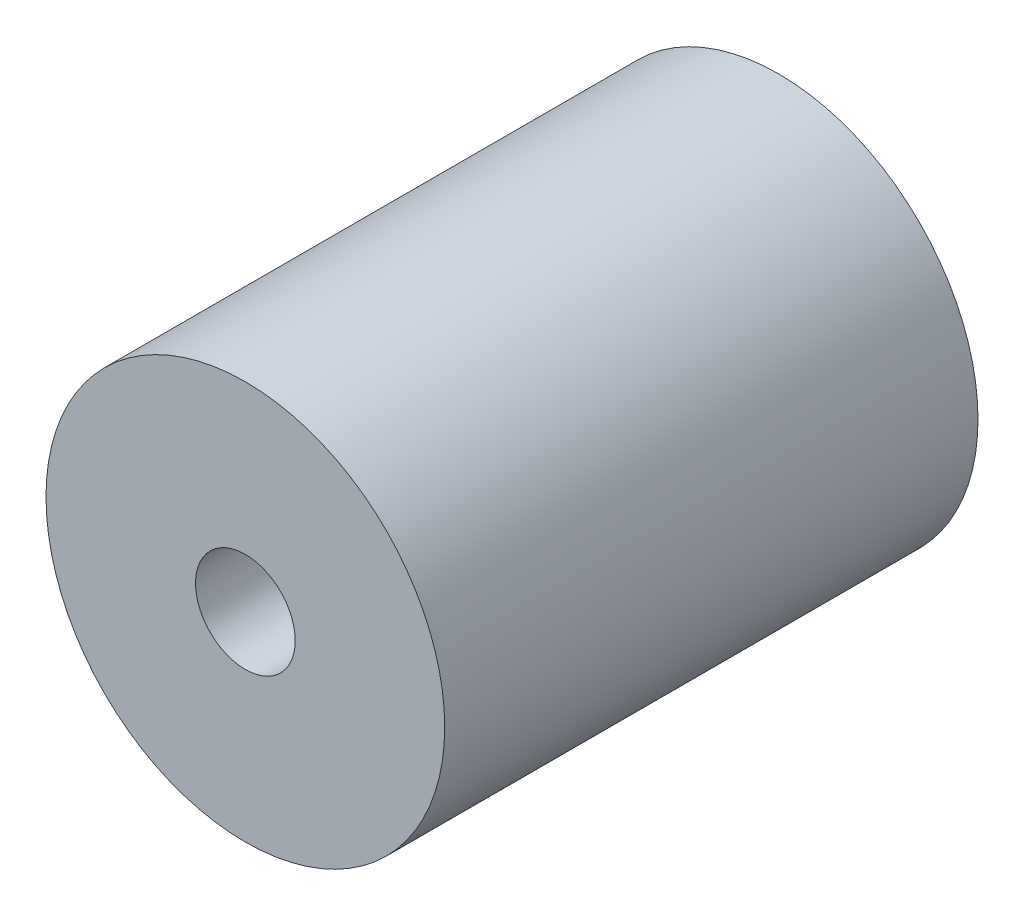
ISO-10303-21;
HEADER;
FILE_DESCRIPTION(('STEP AP214'),'2;1');
FILE_NAME('part.step','',(''),(''),'','','');
FILE_SCHEMA(('AUTOMOTIVE_DESIGN { 1 0 10303 214 1 1 1 1 }'));
ENDSEC;
DATA;
#1=APPLICATION_CONTEXT('core data for automotive mechanical design processes');
#2=APPLICATION_PROTOCOL_DEFINITION('international standard','automotive_design',2000,#1);
#3=PRODUCT_CONTEXT('',#1,'mechanical');
#4=PRODUCT('Part','Part','',(#3));
#5=PRODUCT_RELATED_PRODUCT_CATEGORY('part','',(#4));
#6=PRODUCT_DEFINITION_FORMATION('','',#4);
#7=PRODUCT_DEFINITION_CONTEXT('part definition',#1,'design');
#8=PRODUCT_DEFINITION('design','',#6,#7);
#9=PRODUCT_DEFINITION_SHAPE('','',#8);
#10=(LENGTH_UNIT() NAMED_UNIT(*) SI_UNIT(.MILLI.,.METRE.));
#11=(NAMED_UNIT(*) PLANE_ANGLE_UNIT() SI_UNIT($,.RADIAN.));
#12=(NAMED_UNIT(*) SI_UNIT($,.STERADIAN.) SOLID_ANGLE_UNIT());
#13=UNCERTAINTY_MEASURE_WITH_UNIT(LENGTH_MEASURE(1.E-05),#10,'distance_accuracy_value','');
#14=(GEOMETRIC_REPRESENTATION_CONTEXT(3) GLOBAL_UNCERTAINTY_ASSIGNED_CONTEXT((#13)) GLOBAL_UNIT_ASSIGNED_CONTEXT((#10,
#11,#12)) REPRESENTATION_CONTEXT('',''));
#15=CARTESIAN_POINT('',(0.,0.,0.));
#16=DIRECTION('',(0.,0.,1.));
#17=DIRECTION('',(1.,0.,0.));
#18=AXIS2_PLACEMENT_3D('',#15,#16,#17);
#19=CARTESIAN_POINT('',(0.,0.,10.7));
#20=DIRECTION('',(0.,0.,1.));
#21=DIRECTION('',(1.,0.,0.));
#22=AXIS2_PLACEMENT_3D('',#19,#20,#21);
#23=PLANE('',#22);
#24=CARTESIAN_POINT('',(0.,0.,10.7));
#25=DIRECTION('',(0.,0.,1.));
#26=DIRECTION('',(1.,0.,0.));
#27=AXIS2_PLACEMENT_3D('',#24,#25,#26);
#28=CIRCLE('',#27,4.);
#29=CARTESIAN_POINT('',(4.,0.,10.7));
#30=VERTEX_POINT('',#29);
#31=EDGE_CURVE('E10',#30,#30,#28,.T.);
#32=ORIENTED_EDGE('',*,*,#31,.T.);
#33=EDGE_LOOP('',(#32));
#34=FACE_BOUND('',#33,.T.);
#35=CARTESIAN_POINT('',(0.,0.,10.7));
#36=DIRECTION('',(0.,0.,1.));
#37=DIRECTION('',(1.,0.,0.));
#38=AXIS2_PLACEMENT_3D('',#35,#36,#37);
#39=CIRCLE('',#38,1.);
#40=CARTESIAN_POINT('',(1.,0.,10.7));
#41=VERTEX_POINT('',#40);
#42=EDGE_CURVE('E49',#41,#41,#39,.T.);
#43=ORIENTED_EDGE('',*,*,#42,.F.);
#44=EDGE_LOOP('',(#43));
#45=FACE_BOUND('',#44,.T.);
#46=ADVANCED_FACE('F38',(#34,#45),#23,.T.);
#47=CARTESIAN_POINT('',(0.,0.,0.));
#48=DIRECTION('',(0.,0.,1.));
#49=DIRECTION('',(1.,0.,0.));
#50=AXIS2_PLACEMENT_3D('',#47,#48,#49);
#51=PLANE('',#50);
#52=CARTESIAN_POINT('',(0.,0.,0.));
#53=DIRECTION('',(0.,0.,1.));
#54=DIRECTION('',(1.,0.,0.));
#55=AXIS2_PLACEMENT_3D('',#52,#53,#54);
#56=CIRCLE('',#55,4.);
#57=CARTESIAN_POINT('',(4.,0.,0.));
#58=VERTEX_POINT('',#57);
#59=EDGE_CURVE('E42',#58,#58,#56,.T.);
#60=ORIENTED_EDGE('',*,*,#59,.F.);
#61=EDGE_LOOP('',(#60));
#62=FACE_BOUND('',#61,.T.);
#63=CARTESIAN_POINT('',(0.,0.,0.));
#64=DIRECTION('',(0.,0.,1.));
#65=DIRECTION('',(1.,0.,0.));
#66=AXIS2_PLACEMENT_3D('',#63,#64,#65);
#67=CIRCLE('',#66,1.);
#68=CARTESIAN_POINT('',(1.,0.,0.));
#69=VERTEX_POINT('',#68);
#70=EDGE_CURVE('E51',#69,#69,#67,.T.);
#71=ORIENTED_EDGE('',*,*,#70,.T.);
#72=EDGE_LOOP('',(#71));
#73=FACE_BOUND('',#72,.T.);
#74=ADVANCED_FACE('F61',(#62,#73),#51,.F.);
#75=CARTESIAN_POINT('',(0.,0.,10.7));
#76=DIRECTION('',(0.,0.,-1.));
#77=DIRECTION('',(-1.,0.,0.));
#78=AXIS2_PLACEMENT_3D('',#75,#76,#77);
#79=CYLINDRICAL_SURFACE('',#78,4.);
#80=ORIENTED_EDGE('',*,*,#31,.F.);
#81=EDGE_LOOP('',(#80));
#82=FACE_BOUND('',#81,.T.);
#83=ORIENTED_EDGE('',*,*,#59,.T.);
#84=EDGE_LOOP('',(#83));
#85=FACE_BOUND('',#84,.T.);
#86=ADVANCED_FACE('F40',(#82,#85),#79,.T.);
#87=CARTESIAN_POINT('',(0.,0.,10.7));
#88=DIRECTION('',(0.,0.,-1.));
#89=DIRECTION('',(-1.,0.,0.));
#90=AXIS2_PLACEMENT_3D('',#87,#88,#89);
#91=CYLINDRICAL_SURFACE('',#90,1.);
#92=ORIENTED_EDGE('',*,*,#42,.T.);
#93=EDGE_LOOP('',(#92));
#94=FACE_BOUND('',#93,.T.);
#95=ORIENTED_EDGE('',*,*,#70,.F.);
#96=EDGE_LOOP('',(#95));
#97=FACE_BOUND('',#96,.T.);
#98=ADVANCED_FACE('F57',(#94,#97),#91,.F.);
#99=CLOSED_SHELL('',(#46,#74,#86,#98));
#100=MANIFOLD_SOLID_BREP('B2',#99);
#101=ADVANCED_BREP_SHAPE_REPRESENTATION('',(#18,#100),#14);
#102=SHAPE_DEFINITION_REPRESENTATION(#9,#101);
ENDSEC;
END-ISO-10303-21;
